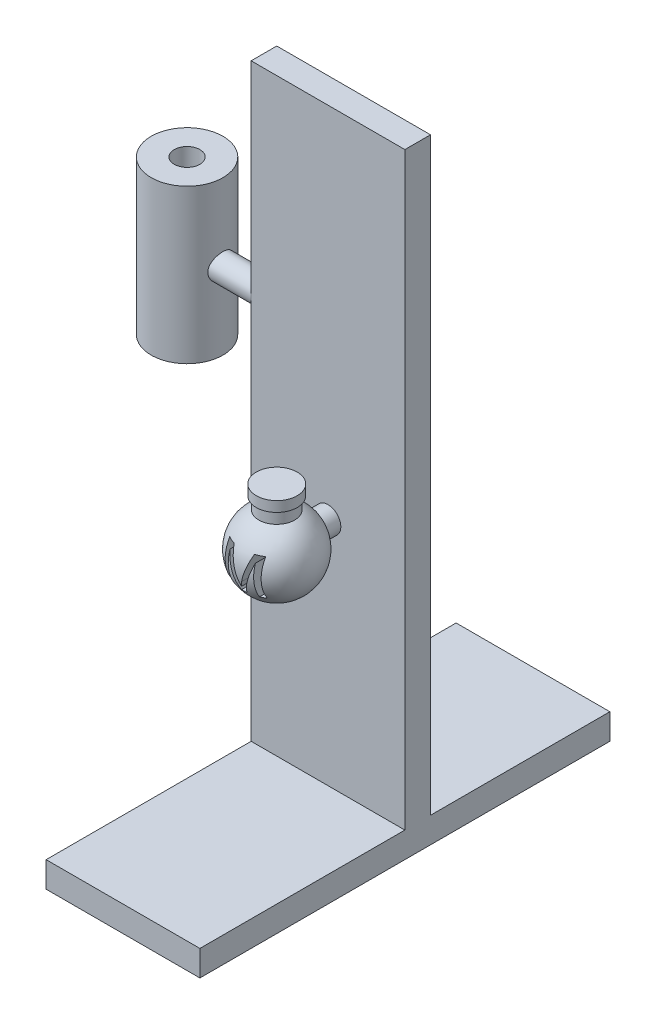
ISO-10303-21;
HEADER;
FILE_DESCRIPTION(('STEP AP214'),'2;1');
FILE_NAME('part.step','',(''),(''),'','','');
FILE_SCHEMA(('AUTOMOTIVE_DESIGN { 1 0 10303 214 1 1 1 1 }'));
ENDSEC;
DATA;
#1=APPLICATION_CONTEXT('core data for automotive mechanical design processes');
#2=APPLICATION_PROTOCOL_DEFINITION('international standard','automotive_design',2000,#1);
#3=PRODUCT_CONTEXT('',#1,'mechanical');
#4=PRODUCT('Part','Part','',(#3));
#5=PRODUCT_RELATED_PRODUCT_CATEGORY('part','',(#4));
#6=PRODUCT_DEFINITION_FORMATION('','',#4);
#7=PRODUCT_DEFINITION_CONTEXT('part definition',#1,'design');
#8=PRODUCT_DEFINITION('design','',#6,#7);
#9=PRODUCT_DEFINITION_SHAPE('','',#8);
#10=(LENGTH_UNIT() NAMED_UNIT(*) SI_UNIT(.MILLI.,.METRE.));
#11=(NAMED_UNIT(*) PLANE_ANGLE_UNIT() SI_UNIT($,.RADIAN.));
#12=(NAMED_UNIT(*) SI_UNIT($,.STERADIAN.) SOLID_ANGLE_UNIT());
#13=UNCERTAINTY_MEASURE_WITH_UNIT(LENGTH_MEASURE(1.E-05),#10,'distance_accuracy_value','');
#14=(GEOMETRIC_REPRESENTATION_CONTEXT(3) GLOBAL_UNCERTAINTY_ASSIGNED_CONTEXT((#13)) GLOBAL_UNIT_ASSIGNED_CONTEXT((#10,
#11,#12)) REPRESENTATION_CONTEXT('',''));
#15=CARTESIAN_POINT('',(0.,0.,0.));
#16=DIRECTION('',(0.,0.,1.));
#17=DIRECTION('',(1.,0.,0.));
#18=AXIS2_PLACEMENT_3D('',#15,#16,#17);
#19=CARTESIAN_POINT('',(0.,120.,5.));
#20=DIRECTION('',(0.,0.,-1.));
#21=DIRECTION('',(-1.,0.,0.));
#22=AXIS2_PLACEMENT_3D('',#19,#20,#21);
#23=PLANE('',#22);
#24=CARTESIAN_POINT('',(15.,50.,5.));
#25=DIRECTION('',(0.,0.,-1.));
#26=DIRECTION('',(-1.,0.,0.));
#27=AXIS2_PLACEMENT_3D('',#24,#25,#26);
#28=CIRCLE('',#27,2.5);
#29=CARTESIAN_POINT('',(12.5,50.,5.));
#30=VERTEX_POINT('',#29);
#31=EDGE_CURVE('E346',#30,#30,#28,.F.);
#32=ORIENTED_EDGE('',*,*,#31,.F.);
#33=EDGE_LOOP('',(#32));
#34=FACE_BOUND('',#33,.T.);
#35=DIRECTION('',(-1.,0.,0.));
#36=VECTOR('',#35,1.);
#37=CARTESIAN_POINT('',(0.,5.,5.));
#38=LINE('',#37,#36);
#39=CARTESIAN_POINT('',(30.,5.,5.));
#40=VERTEX_POINT('',#39);
#41=CARTESIAN_POINT('',(0.,5.,5.));
#42=VERTEX_POINT('',#41);
#43=EDGE_CURVE('E55',#40,#42,#38,.T.);
#44=ORIENTED_EDGE('',*,*,#43,.F.);
#45=DIRECTION('',(0.,1.,0.));
#46=VECTOR('',#45,1.);
#47=CARTESIAN_POINT('',(30.,0.,5.));
#48=LINE('',#47,#46);
#49=CARTESIAN_POINT('',(30.,120.,5.));
#50=VERTEX_POINT('',#49);
#51=EDGE_CURVE('E417',#40,#50,#48,.T.);
#52=ORIENTED_EDGE('',*,*,#51,.T.);
#53=DIRECTION('',(-1.,0.,0.));
#54=VECTOR('',#53,1.);
#55=CARTESIAN_POINT('',(0.,120.,5.));
#56=LINE('',#55,#54);
#57=CARTESIAN_POINT('',(0.,120.,5.));
#58=VERTEX_POINT('',#57);
#59=EDGE_CURVE('E419',#50,#58,#56,.T.);
#60=ORIENTED_EDGE('',*,*,#59,.T.);
#61=DIRECTION('',(0.,-1.,0.));
#62=VECTOR('',#61,1.);
#63=CARTESIAN_POINT('',(0.,0.,5.));
#64=LINE('',#63,#62);
#65=CARTESIAN_POINT('',(0.,80.,5.));
#66=VERTEX_POINT('',#65);
#67=EDGE_CURVE('E415',#58,#66,#64,.T.);
#68=ORIENTED_EDGE('',*,*,#67,.T.);
#69=EDGE_CURVE('E414',#66,#42,#64,.T.);
#70=ORIENTED_EDGE('',*,*,#69,.T.);
#71=EDGE_LOOP('',(#44,#52,#60,#68,#70));
#72=FACE_BOUND('',#71,.T.);
#73=ADVANCED_FACE('F32',(#34,#72),#23,.F.);
#74=CARTESIAN_POINT('',(0.,120.,0.));
#75=DIRECTION('',(0.,0.,-1.));
#76=DIRECTION('',(-1.,0.,0.));
#77=AXIS2_PLACEMENT_3D('',#74,#75,#76);
#78=PLANE('',#77);
#79=DIRECTION('',(0.,1.,0.));
#80=VECTOR('',#79,1.);
#81=CARTESIAN_POINT('',(30.,0.,0.));
#82=LINE('',#81,#80);
#83=CARTESIAN_POINT('',(30.,5.,0.));
#84=VERTEX_POINT('',#83);
#85=CARTESIAN_POINT('',(30.,120.,0.));
#86=VERTEX_POINT('',#85);
#87=EDGE_CURVE('E409',#84,#86,#82,.T.);
#88=ORIENTED_EDGE('',*,*,#87,.F.);
#89=DIRECTION('',(-1.,0.,0.));
#90=VECTOR('',#89,1.);
#91=CARTESIAN_POINT('',(0.,5.,0.));
#92=LINE('',#91,#90);
#93=CARTESIAN_POINT('',(0.,5.,0.));
#94=VERTEX_POINT('',#93);
#95=EDGE_CURVE('E442',#84,#94,#92,.T.);
#96=ORIENTED_EDGE('',*,*,#95,.T.);
#97=DIRECTION('',(0.,-1.,0.));
#98=VECTOR('',#97,1.);
#99=CARTESIAN_POINT('',(0.,0.,0.));
#100=LINE('',#99,#98);
#101=CARTESIAN_POINT('',(0.,80.,0.));
#102=VERTEX_POINT('',#101);
#103=EDGE_CURVE('E410',#102,#94,#100,.T.);
#104=ORIENTED_EDGE('',*,*,#103,.F.);
#105=CARTESIAN_POINT('',(0.,120.,0.));
#106=VERTEX_POINT('',#105);
#107=EDGE_CURVE('E406',#106,#102,#100,.T.);
#108=ORIENTED_EDGE('',*,*,#107,.F.);
#109=DIRECTION('',(-1.,0.,0.));
#110=VECTOR('',#109,1.);
#111=CARTESIAN_POINT('',(0.,120.,0.));
#112=LINE('',#111,#110);
#113=EDGE_CURVE('E412',#86,#106,#112,.T.);
#114=ORIENTED_EDGE('',*,*,#113,.F.);
#115=EDGE_LOOP('',(#88,#96,#104,#108,#114));
#116=FACE_BOUND('',#115,.T.);
#117=ADVANCED_FACE('F314',(#116),#78,.T.);
#118=CARTESIAN_POINT('',(-15.,80.,2.5));
#119=DIRECTION('',(1.,0.,0.));
#120=DIRECTION('',(0.,0.,-1.));
#121=AXIS2_PLACEMENT_3D('',#118,#119,#120);
#122=CYLINDRICAL_SURFACE('',#121,2.5);
#123=CARTESIAN_POINT('',(0.,80.,2.5));
#124=DIRECTION('',(-1.,0.,0.));
#125=DIRECTION('',(0.,0.,1.));
#126=AXIS2_PLACEMENT_3D('',#123,#124,#125);
#127=CIRCLE('',#126,2.5);
#128=EDGE_CURVE('E392',#66,#102,#127,.T.);
#129=ORIENTED_EDGE('',*,*,#128,.T.);
#130=EDGE_CURVE('E396',#102,#66,#127,.T.);
#131=ORIENTED_EDGE('',*,*,#130,.T.);
#132=EDGE_LOOP('',(#129,#131));
#133=FACE_BOUND('',#132,.T.);
#134=CARTESIAN_POINT('',(-8.46165158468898,80.,0.));
#135=CARTESIAN_POINT('',(-8.46165415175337,79.8644729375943,-2.93142536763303E-06));
#136=CARTESIAN_POINT('',(-8.45739186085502,79.7289661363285,0.0110575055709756));
#137=CARTESIAN_POINT('',(-8.44090884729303,79.4620070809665,0.0548290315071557));
#138=CARTESIAN_POINT('',(-8.42868773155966,79.3305550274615,0.0875411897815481));
#139=CARTESIAN_POINT('',(-8.39784418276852,79.0756252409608,0.173288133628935));
#140=CARTESIAN_POINT('',(-8.37923583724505,78.9521306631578,0.226278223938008));
#141=CARTESIAN_POINT('',(-8.33773622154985,78.7157391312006,0.350920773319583));
#142=CARTESIAN_POINT('',(-8.3148438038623,78.6028450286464,0.422578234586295));
#143=CARTESIAN_POINT('',(-8.26620067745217,78.3857788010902,0.585975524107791));
#144=CARTESIAN_POINT('',(-8.24037136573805,78.2821521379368,0.678416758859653));
#145=CARTESIAN_POINT('',(-8.18942419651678,78.0914931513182,0.87926548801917));
#146=CARTESIAN_POINT('',(-8.16430647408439,78.004463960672,0.987675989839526));
#147=CARTESIAN_POINT('',(-8.11668902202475,77.8469109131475,1.22145912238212));
#148=CARTESIAN_POINT('',(-8.09429233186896,77.7769705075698,1.34724781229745));
#149=CARTESIAN_POINT('',(-8.05557693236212,77.659464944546,1.60974493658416));
#150=CARTESIAN_POINT('',(-8.03925632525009,77.6118927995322,1.74644994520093));
#151=CARTESIAN_POINT('',(-8.01508938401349,77.5423590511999,2.0211712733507));
#152=CARTESIAN_POINT('',(-8.00693390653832,77.5194604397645,2.15892271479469));
#153=CARTESIAN_POINT('',(-7.99891202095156,77.4969316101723,2.43653827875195));
#154=CARTESIAN_POINT('',(-7.99904316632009,77.4972945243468,2.57640176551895));
#155=CARTESIAN_POINT('',(-8.00737739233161,77.5207111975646,2.84759237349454));
#156=CARTESIAN_POINT('',(-8.01521745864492,77.5427445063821,2.97902065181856));
#157=CARTESIAN_POINT('',(-8.03762148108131,77.6071728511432,3.23617413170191));
#158=CARTESIAN_POINT('',(-8.05218590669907,77.6495693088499,3.36189893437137));
#159=CARTESIAN_POINT('',(-8.08683492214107,77.7540469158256,3.60616096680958));
#160=CARTESIAN_POINT('',(-8.10699405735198,77.8163957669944,3.72457268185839));
#161=CARTESIAN_POINT('',(-8.1507664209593,77.9587791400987,3.94953519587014));
#162=CARTESIAN_POINT('',(-8.17438070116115,78.0388190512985,4.05608236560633));
#163=CARTESIAN_POINT('',(-8.22409646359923,78.2193307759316,4.26033248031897));
#164=CARTESIAN_POINT('',(-8.25026342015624,78.3206669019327,4.35725678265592));
#165=CARTESIAN_POINT('',(-8.3011003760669,78.5383434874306,4.53301110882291));
#166=CARTESIAN_POINT('',(-8.32577006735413,78.6546870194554,4.61183741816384));
#167=CARTESIAN_POINT('',(-8.37120875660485,78.9018776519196,4.75045901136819));
#168=CARTESIAN_POINT('',(-8.39189723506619,79.0329530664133,4.80987563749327));
#169=CARTESIAN_POINT('',(-8.42610260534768,79.304179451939,4.90551106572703));
#170=CARTESIAN_POINT('',(-8.43962304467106,79.4443258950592,4.94174134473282));
#171=CARTESIAN_POINT('',(-8.45713994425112,79.7220838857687,4.98828716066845));
#172=CARTESIAN_POINT('',(-8.46158583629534,79.859461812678,4.99982704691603));
#173=CARTESIAN_POINT('',(-8.46171581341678,80.1342333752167,5.00016897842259));
#174=CARTESIAN_POINT('',(-8.45740180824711,80.2716270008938,4.98897597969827));
#175=CARTESIAN_POINT('',(-8.44095095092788,80.5365737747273,4.94527599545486));
#176=CARTESIAN_POINT('',(-8.42914582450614,80.6642987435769,4.91367185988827));
#177=CARTESIAN_POINT('',(-8.39942381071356,80.9125899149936,4.83115923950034));
#178=CARTESIAN_POINT('',(-8.38150574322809,81.0331547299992,4.78024702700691));
#179=CARTESIAN_POINT('',(-8.34080102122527,81.2684001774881,4.65854403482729));
#180=CARTESIAN_POINT('',(-8.31786560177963,81.3827259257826,4.58711845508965));
#181=CARTESIAN_POINT('',(-8.2699770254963,81.598207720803,4.42711056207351));
#182=CARTESIAN_POINT('',(-8.24502319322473,81.6993593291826,4.33852249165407));
#183=CARTESIAN_POINT('',(-8.1942043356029,81.8915426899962,4.14077043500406));
#184=CARTESIAN_POINT('',(-8.16836752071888,81.9816793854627,4.03072651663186));
#185=CARTESIAN_POINT('',(-8.12006270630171,82.1422926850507,3.79643714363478));
#186=CARTESIAN_POINT('',(-8.09759465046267,82.2127696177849,3.67219192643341));
#187=CARTESIAN_POINT('',(-8.05862015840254,82.3315002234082,3.41338047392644));
#188=CARTESIAN_POINT('',(-8.04208373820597,82.3798660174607,3.27887043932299));
#189=CARTESIAN_POINT('',(-8.01671664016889,82.4530468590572,3.00290689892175));
#190=CARTESIAN_POINT('',(-8.00788271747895,82.4778718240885,2.86145634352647));
#191=CARTESIAN_POINT('',(-7.9991961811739,82.5022729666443,2.58375750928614));
#192=CARTESIAN_POINT('',(-7.99888934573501,82.5031261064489,2.44763455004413));
#193=CARTESIAN_POINT('',(-8.00613634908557,82.4827846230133,2.17727319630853));
#194=CARTESIAN_POINT('',(-8.01368938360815,82.4615922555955,2.04303461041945));
#195=CARTESIAN_POINT('',(-8.03561688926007,82.3986398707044,1.78301867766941));
#196=CARTESIAN_POINT('',(-8.04984871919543,82.3573092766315,1.65712444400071));
#197=CARTESIAN_POINT('',(-8.08366112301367,82.2556669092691,1.41402856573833));
#198=CARTESIAN_POINT('',(-8.10324269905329,82.1953515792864,1.29682855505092));
#199=CARTESIAN_POINT('',(-8.14674509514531,82.0546886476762,1.06931766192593));
#200=CARTESIAN_POINT('',(-8.17080828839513,81.9736355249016,0.959470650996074));
#201=CARTESIAN_POINT('',(-8.22028953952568,81.7949475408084,0.75453152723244));
#202=CARTESIAN_POINT('',(-8.24570805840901,81.6973070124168,0.659444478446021));
#203=CARTESIAN_POINT('',(-8.29647116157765,81.4827811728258,0.482177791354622));
#204=CARTESIAN_POINT('',(-8.32175686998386,81.3652101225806,0.400808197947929));
#205=CARTESIAN_POINT('',(-8.36799648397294,81.1172615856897,0.258992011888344));
#206=CARTESIAN_POINT('',(-8.38895068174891,80.9868849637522,0.198544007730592));
#207=CARTESIAN_POINT('',(-8.42390786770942,80.7162590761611,0.100466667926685));
#208=CARTESIAN_POINT('',(-8.43788173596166,80.5759711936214,0.0629327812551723));
#209=CARTESIAN_POINT('',(-8.4567499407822,80.2904461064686,0.0127072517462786));
#210=CARTESIAN_POINT('',(-8.46164883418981,80.1452114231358,3.14089630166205E-06));
#211=CARTESIAN_POINT('',(-8.46165158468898,80.,0.));
#212=B_SPLINE_CURVE_WITH_KNOTS('',3,(#134,#135,#136,#137,#138,#139,#140,#141,#142,#143,#144,
#145,#146,#147,#148,#149,#150,#151,#152,#153,#154,#155,#156,#157,#158,#159,#160,#161,#162,#163,
#164,#165,#166,#167,#168,#169,#170,#171,#172,#173,#174,#175,#176,#177,#178,#179,#180,#181,#182,
#183,#184,#185,#186,#187,#188,#189,#190,#191,#192,#193,#194,#195,#196,#197,#198,#199,#200,#201,
#202,#203,#204,#205,#206,#207,#208,#209,#210,#211),.UNSPECIFIED.,.T.,.F.,(4,2,2,2,2,2,2,2,2,2,2,
2,2,2,2,2,2,2,2,2,2,2,2,2,2,2,2,2,2,2,2,2,2,2,2,2,2,2,4),(0.,0.406041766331,0.812103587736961,
1.21727550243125,1.62255610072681,2.04441002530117,2.46634349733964,2.90112813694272,
3.33577686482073,3.75326460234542,4.17062908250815,4.56923737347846,4.96787349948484,
5.37209971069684,5.77644923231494,6.20244167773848,6.62852147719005,7.06247609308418,
7.49621574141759,7.90789453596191,8.31948358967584,8.71400941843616,9.10861145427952,
9.5170588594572,9.92564351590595,10.3573204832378,10.7889902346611,11.2184461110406,
11.6477209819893,12.0540827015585,12.4604028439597,12.8584146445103,13.2565010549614,
13.67053016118,14.0847010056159,14.5182116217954,14.9516929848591,15.386967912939,
15.8220242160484),.UNSPECIFIED.);
#213=CARTESIAN_POINT('',(-8.46165158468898,80.,0.));
#214=VERTEX_POINT('',#213);
#215=EDGE_CURVE('E435',#214,#214,#212,.T.);
#216=ORIENTED_EDGE('',*,*,#215,.F.);
#217=EDGE_LOOP('',(#216));
#218=FACE_BOUND('',#217,.T.);
#219=ADVANCED_FACE('F317',(#133,#218),#122,.T.);
#220=CARTESIAN_POINT('',(0.,0.,5.));
#221=DIRECTION('',(1.,0.,0.));
#222=DIRECTION('',(0.,0.,-1.));
#223=AXIS2_PLACEMENT_3D('',#220,#221,#222);
#224=PLANE('',#223);
#225=ORIENTED_EDGE('',*,*,#128,.F.);
#226=ORIENTED_EDGE('',*,*,#67,.F.);
#227=DIRECTION('',(0.,0.,-1.));
#228=VECTOR('',#227,1.);
#229=CARTESIAN_POINT('',(0.,120.,5.));
#230=LINE('',#229,#228);
#231=EDGE_CURVE('E421',#58,#106,#230,.T.);
#232=ORIENTED_EDGE('',*,*,#231,.T.);
#233=ORIENTED_EDGE('',*,*,#107,.T.);
#234=EDGE_LOOP('',(#225,#226,#232,#233));
#235=FACE_BOUND('',#234,.T.);
#236=ADVANCED_FACE('F34',(#235),#224,.F.);
#237=DIRECTION('',(0.,0.,-1.));
#238=VECTOR('',#237,1.);
#239=CARTESIAN_POINT('',(0.,0.,5.));
#240=LINE('',#239,#238);
#241=CARTESIAN_POINT('',(0.,0.,45.));
#242=VERTEX_POINT('',#241);
#243=CARTESIAN_POINT('',(0.,0.,-35.));
#244=VERTEX_POINT('',#243);
#245=EDGE_CURVE('E338',#242,#244,#240,.T.);
#246=ORIENTED_EDGE('',*,*,#245,.F.);
#247=DIRECTION('',(0.,-1.,0.));
#248=VECTOR('',#247,1.);
#249=CARTESIAN_POINT('',(0.,0.,45.));
#250=LINE('',#249,#248);
#251=CARTESIAN_POINT('',(0.,5.,45.));
#252=VERTEX_POINT('',#251);
#253=EDGE_CURVE('E371',#252,#242,#250,.T.);
#254=ORIENTED_EDGE('',*,*,#253,.F.);
#255=DIRECTION('',(0.,0.,-1.));
#256=VECTOR('',#255,1.);
#257=CARTESIAN_POINT('',(0.,5.,45.));
#258=LINE('',#257,#256);
#259=EDGE_CURVE('E378',#252,#42,#258,.T.);
#260=ORIENTED_EDGE('',*,*,#259,.T.);
#261=ORIENTED_EDGE('',*,*,#69,.F.);
#262=ORIENTED_EDGE('',*,*,#130,.F.);
#263=ORIENTED_EDGE('',*,*,#103,.T.);
#264=CARTESIAN_POINT('',(0.,5.,-35.));
#265=VERTEX_POINT('',#264);
#266=EDGE_CURVE('E360',#94,#265,#258,.T.);
#267=ORIENTED_EDGE('',*,*,#266,.T.);
#268=DIRECTION('',(0.,-1.,0.));
#269=VECTOR('',#268,1.);
#270=CARTESIAN_POINT('',(0.,0.,-35.));
#271=LINE('',#270,#269);
#272=EDGE_CURVE('E354',#265,#244,#271,.T.);
#273=ORIENTED_EDGE('',*,*,#272,.T.);
#274=EDGE_LOOP('',(#246,#254,#260,#261,#262,#263,#267,#273));
#275=FACE_BOUND('',#274,.T.);
#276=ADVANCED_FACE('F330',(#275),#224,.F.);
#277=CARTESIAN_POINT('',(0.,0.,5.));
#278=DIRECTION('',(0.,1.,0.));
#279=DIRECTION('',(0.,0.,1.));
#280=AXIS2_PLACEMENT_3D('',#277,#278,#279);
#281=PLANE('',#280);
#282=ORIENTED_EDGE('',*,*,#245,.T.);
#283=DIRECTION('',(1.,0.,0.));
#284=VECTOR('',#283,1.);
#285=CARTESIAN_POINT('',(0.,0.,-35.));
#286=LINE('',#285,#284);
#287=CARTESIAN_POINT('',(30.,0.,-35.));
#288=VERTEX_POINT('',#287);
#289=EDGE_CURVE('E340',#244,#288,#286,.T.);
#290=ORIENTED_EDGE('',*,*,#289,.T.);
#291=DIRECTION('',(0.,0.,-1.));
#292=VECTOR('',#291,1.);
#293=CARTESIAN_POINT('',(30.,0.,5.));
#294=LINE('',#293,#292);
#295=CARTESIAN_POINT('',(30.,0.,45.));
#296=VERTEX_POINT('',#295);
#297=EDGE_CURVE('E347',#296,#288,#294,.T.);
#298=ORIENTED_EDGE('',*,*,#297,.F.);
#299=DIRECTION('',(1.,0.,0.));
#300=VECTOR('',#299,1.);
#301=CARTESIAN_POINT('',(0.,0.,45.));
#302=LINE('',#301,#300);
#303=EDGE_CURVE('E342',#242,#296,#302,.T.);
#304=ORIENTED_EDGE('',*,*,#303,.F.);
#305=EDGE_LOOP('',(#282,#290,#298,#304));
#306=FACE_BOUND('',#305,.T.);
#307=ADVANCED_FACE('F327',(#306),#281,.F.);
#308=CARTESIAN_POINT('',(30.,0.,5.));
#309=DIRECTION('',(-1.,0.,0.));
#310=DIRECTION('',(0.,0.,1.));
#311=AXIS2_PLACEMENT_3D('',#308,#309,#310);
#312=PLANE('',#311);
#313=ORIENTED_EDGE('',*,*,#297,.T.);
#314=DIRECTION('',(0.,1.,0.));
#315=VECTOR('',#314,1.);
#316=CARTESIAN_POINT('',(30.,0.,-35.));
#317=LINE('',#316,#315);
#318=CARTESIAN_POINT('',(30.,5.,-35.));
#319=VERTEX_POINT('',#318);
#320=EDGE_CURVE('E357',#288,#319,#317,.T.);
#321=ORIENTED_EDGE('',*,*,#320,.T.);
#322=DIRECTION('',(0.,0.,-1.));
#323=VECTOR('',#322,1.);
#324=CARTESIAN_POINT('',(30.,5.,45.));
#325=LINE('',#324,#323);
#326=EDGE_CURVE('E381',#84,#319,#325,.T.);
#327=ORIENTED_EDGE('',*,*,#326,.F.);
#328=ORIENTED_EDGE('',*,*,#87,.T.);
#329=DIRECTION('',(0.,0.,-1.));
#330=VECTOR('',#329,1.);
#331=CARTESIAN_POINT('',(30.,120.,5.));
#332=LINE('',#331,#330);
#333=EDGE_CURVE('E424',#50,#86,#332,.T.);
#334=ORIENTED_EDGE('',*,*,#333,.F.);
#335=ORIENTED_EDGE('',*,*,#51,.F.);
#336=CARTESIAN_POINT('',(30.,5.,45.));
#337=VERTEX_POINT('',#336);
#338=EDGE_CURVE('E382',#337,#40,#325,.T.);
#339=ORIENTED_EDGE('',*,*,#338,.F.);
#340=DIRECTION('',(0.,1.,0.));
#341=VECTOR('',#340,1.);
#342=CARTESIAN_POINT('',(30.,0.,45.));
#343=LINE('',#342,#341);
#344=EDGE_CURVE('E374',#296,#337,#343,.T.);
#345=ORIENTED_EDGE('',*,*,#344,.F.);
#346=EDGE_LOOP('',(#313,#321,#327,#328,#334,#335,#339,#345));
#347=FACE_BOUND('',#346,.T.);
#348=ADVANCED_FACE('F324',(#347),#312,.F.);
#349=CARTESIAN_POINT('',(0.,120.,5.));
#350=DIRECTION('',(0.,-1.,0.));
#351=DIRECTION('',(0.,0.,-1.));
#352=AXIS2_PLACEMENT_3D('',#349,#350,#351);
#353=PLANE('',#352);
#354=ORIENTED_EDGE('',*,*,#113,.T.);
#355=ORIENTED_EDGE('',*,*,#231,.F.);
#356=ORIENTED_EDGE('',*,*,#59,.F.);
#357=ORIENTED_EDGE('',*,*,#333,.T.);
#358=EDGE_LOOP('',(#354,#355,#356,#357));
#359=FACE_BOUND('',#358,.T.);
#360=ADVANCED_FACE('F312',(#359),#353,.F.);
#361=CARTESIAN_POINT('',(15.,50.,15.));
#362=DIRECTION('',(0.,0.,-1.));
#363=DIRECTION('',(-1.,0.,0.));
#364=AXIS2_PLACEMENT_3D('',#361,#362,#363);
#365=CYLINDRICAL_SURFACE('',#364,2.5);
#366=CARTESIAN_POINT('',(15.,50.,7.92893218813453));
#367=DIRECTION('',(0.,0.,1.));
#368=DIRECTION('',(1.,0.,0.));
#369=AXIS2_PLACEMENT_3D('',#366,#367,#368);
#370=CIRCLE('',#369,2.5);
#371=CARTESIAN_POINT('',(17.5,50.,7.92893218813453));
#372=VERTEX_POINT('',#371);
#373=EDGE_CURVE('E405',#372,#372,#370,.F.);
#374=ORIENTED_EDGE('',*,*,#373,.T.);
#375=EDGE_LOOP('',(#374));
#376=FACE_BOUND('',#375,.T.);
#377=ORIENTED_EDGE('',*,*,#31,.T.);
#378=EDGE_LOOP('',(#377));
#379=FACE_BOUND('',#378,.T.);
#380=ADVANCED_FACE('F306',(#376,#379),#365,.T.);
#381=CARTESIAN_POINT('',(15.,50.,15.));
#382=DIRECTION('',(0.,1.,0.));
#383=DIRECTION('',(1.,0.,0.));
#384=AXIS2_PLACEMENT_3D('',#381,#382,#383);
#385=SPHERICAL_SURFACE('',#384,7.5);
#386=CARTESIAN_POINT('',(15.,46.1322622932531,15.));
#387=DIRECTION('',(0.,-1.,0.));
#388=DIRECTION('',(0.,0.,-1.));
#389=AXIS2_PLACEMENT_3D('',#386,#387,#388);
#390=CIRCLE('',#389,6.42577660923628);
#391=CARTESIAN_POINT('',(11.6406029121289,46.1322622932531,20.4776871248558));
#392=VERTEX_POINT('',#391);
#393=CARTESIAN_POINT('',(12.6547595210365,46.1322622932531,20.9825121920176));
#394=VERTEX_POINT('',#393);
#395=EDGE_CURVE('E11',#392,#394,#390,.F.);
#396=ORIENTED_EDGE('',*,*,#395,.F.);
#397=CARTESIAN_POINT('',(11.6406029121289,50.,15.));
#398=DIRECTION('',(-1.,0.,0.));
#399=DIRECTION('',(0.,0.,1.));
#400=AXIS2_PLACEMENT_3D('',#397,#398,#399);
#401=CIRCLE('',#400,6.70555375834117);
#402=CARTESIAN_POINT('',(11.6406029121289,53.3235546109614,20.8239536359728));
#403=VERTEX_POINT('',#402);
#404=EDGE_CURVE('E195',#403,#392,#401,.F.);
#405=ORIENTED_EDGE('',*,*,#404,.F.);
#406=CARTESIAN_POINT('',(15.,53.3235546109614,15.));
#407=DIRECTION('',(0.,1.,0.));
#408=DIRECTION('',(0.,0.,1.));
#409=AXIS2_PLACEMENT_3D('',#406,#407,#408);
#410=CIRCLE('',#409,6.72339086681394);
#411=CARTESIAN_POINT('',(13.1661595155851,53.3235546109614,21.4684630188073));
#412=VERTEX_POINT('',#411);
#413=EDGE_CURVE('E497',#412,#403,#410,.F.);
#414=ORIENTED_EDGE('',*,*,#413,.F.);
#415=CARTESIAN_POINT('',(14.2964032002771,49.7758452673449,15.));
#416=DIRECTION('',(0.95281497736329,0.303551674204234,0.));
#417=DIRECTION('',(-0.303551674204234,0.95281497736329,0.));
#418=AXIS2_PLACEMENT_3D('',#415,#416,#417);
#419=CIRCLE('',#418,7.46355854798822);
#420=CARTESIAN_POINT('',(14.773828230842,48.2772611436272,22.2959589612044));
#421=VERTEX_POINT('',#420);
#422=EDGE_CURVE('E294',#421,#412,#419,.F.);
#423=ORIENTED_EDGE('',*,*,#422,.F.);
#424=CARTESIAN_POINT('',(15.0979549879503,47.2213281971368,21.965585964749));
#425=CARTESIAN_POINT('',(15.0948564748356,47.2320672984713,21.9699135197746));
#426=CARTESIAN_POINT('',(15.0917557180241,47.2428166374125,21.9742142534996));
#427=CARTESIAN_POINT('',(15.0855212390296,47.2643281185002,21.9827594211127));
#428=CARTESIAN_POINT('',(15.0823875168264,47.2750902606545,21.9870038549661));
#429=CARTESIAN_POINT('',(15.0760587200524,47.2966193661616,21.9954336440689));
#430=CARTESIAN_POINT('',(15.0728636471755,47.3073863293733,21.9996190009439));
#431=CARTESIAN_POINT('',(15.0663899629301,47.328918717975,22.0079284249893));
#432=CARTESIAN_POINT('',(15.0631113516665,47.3396841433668,22.0120524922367));
#433=CARTESIAN_POINT('',(15.0532149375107,47.3719947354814,22.0243384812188));
#434=CARTESIAN_POINT('',(15.0465365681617,47.3935541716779,22.0324141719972));
#435=CARTESIAN_POINT('',(15.033379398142,47.4368065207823,22.0483685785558));
#436=CARTESIAN_POINT('',(15.026900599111,47.4584994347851,22.0562472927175));
#437=CARTESIAN_POINT('',(15.0139228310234,47.5019520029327,22.0717845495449));
#438=CARTESIAN_POINT('',(15.0074238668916,47.5237116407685,22.0794431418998));
#439=CARTESIAN_POINT('',(14.9942141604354,47.5672486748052,22.0945233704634));
#440=CARTESIAN_POINT('',(14.9875034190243,47.5890260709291,22.1019450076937));
#441=CARTESIAN_POINT('',(14.9740568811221,47.6326462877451,22.1165678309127));
#442=CARTESIAN_POINT('',(14.9673210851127,47.6544891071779,22.1237690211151));
#443=CARTESIAN_POINT('',(14.953916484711,47.6982640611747,22.1379592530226));
#444=CARTESIAN_POINT('',(14.9472476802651,47.7201961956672,22.1449482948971));
#445=CARTESIAN_POINT('',(14.9338333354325,47.7642432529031,22.1587425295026));
#446=CARTESIAN_POINT('',(14.9270875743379,47.7863585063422,22.165546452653));
#447=CARTESIAN_POINT('',(14.9134921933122,47.8306268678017,22.1789217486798));
#448=CARTESIAN_POINT('',(14.9066425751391,47.8527799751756,22.1854931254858));
#449=CARTESIAN_POINT('',(14.8859501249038,47.919295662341,22.20485845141));
#450=CARTESIAN_POINT('',(14.8719633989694,47.9637155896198,22.2173039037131));
#451=CARTESIAN_POINT('',(14.8508627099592,48.0305279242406,22.2352968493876));
#452=CARTESIAN_POINT('',(14.8438035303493,48.0528464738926,22.241186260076));
#453=CARTESIAN_POINT('',(14.8297216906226,48.097552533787,22.2527430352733));
#454=CARTESIAN_POINT('',(14.8226990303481,48.119940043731,22.2584104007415));
#455=CARTESIAN_POINT('',(14.8086972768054,48.1647839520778,22.2695232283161));
#456=CARTESIAN_POINT('',(14.8017181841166,48.1872403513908,22.2749686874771));
#457=CARTESIAN_POINT('',(14.7877720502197,48.2322105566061,22.2856339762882));
#458=CARTESIAN_POINT('',(14.7808050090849,48.2547243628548,22.2908538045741));
#459=CARTESIAN_POINT('',(14.773828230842,48.2772611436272,22.2959589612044));
#460=B_SPLINE_CURVE_WITH_KNOTS('',3,(#424,#425,#426,#427,#428,#429,#430,#431,#432,#433,#434,
#435,#436,#437,#438,#439,#440,#441,#442,#443,#444,#445,#446,#447,#448,#449,#450,#451,#452,#453,
#454,#455,#456,#457,#458,#459),.UNSPECIFIED.,.F.,.F.,(4,2,2,2,2,2,2,2,2,2,2,2,2,2,2,2,2,4),(0.,
0.0359571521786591,0.0719143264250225,0.10787050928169,0.143826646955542,0.215739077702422,
0.287652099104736,0.35954875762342,0.431445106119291,0.503340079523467,0.575234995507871,
0.647538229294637,0.719840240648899,0.864441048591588,0.936853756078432,1.00926615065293,
1.08167950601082,1.15409329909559),.UNSPECIFIED.);
#461=CARTESIAN_POINT('',(15.0979549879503,47.2213281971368,21.965585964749));
#462=VERTEX_POINT('',#461);
#463=EDGE_CURVE('E286',#462,#421,#460,.T.);
#464=ORIENTED_EDGE('',*,*,#463,.F.);
#465=CARTESIAN_POINT('',(15.450893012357,48.3636949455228,22.305422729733));
#466=CARTESIAN_POINT('',(15.4433276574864,48.3395188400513,22.3004745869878));
#467=CARTESIAN_POINT('',(15.4357767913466,48.3153652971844,22.2953938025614));
#468=CARTESIAN_POINT('',(15.4206447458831,48.2671231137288,22.2849750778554));
#469=CARTESIAN_POINT('',(15.4130635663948,48.2430344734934,22.2796371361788));
#470=CARTESIAN_POINT('',(15.3978111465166,48.194940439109,22.2687118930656));
#471=CARTESIAN_POINT('',(15.3901398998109,48.1709350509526,22.2631245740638));
#472=CARTESIAN_POINT('',(15.3747541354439,48.1229992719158,22.2516959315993));
#473=CARTESIAN_POINT('',(15.3670396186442,48.0990688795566,22.245854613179));
#474=CARTESIAN_POINT('',(15.3536248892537,48.0571477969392,22.2353750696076));
#475=CARTESIAN_POINT('',(15.3478980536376,48.0391508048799,22.2307962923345));
#476=CARTESIAN_POINT('',(15.3365848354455,48.0031551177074,22.2214748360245));
#477=CARTESIAN_POINT('',(15.3309984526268,47.9851564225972,22.2167321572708));
#478=CARTESIAN_POINT('',(15.314390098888,47.9311765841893,22.2022662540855));
#479=CARTESIAN_POINT('',(15.3035192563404,47.8952127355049,22.1923054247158));
#480=CARTESIAN_POINT('',(15.2816443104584,47.8234870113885,22.1718183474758));
#481=CARTESIAN_POINT('',(15.2706402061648,47.7877251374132,22.1612920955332));
#482=CARTESIAN_POINT('',(15.2539449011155,47.7342665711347,22.1450921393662));
#483=CARTESIAN_POINT('',(15.2483483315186,47.7164779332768,22.1396237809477));
#484=CARTESIAN_POINT('',(15.2370877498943,47.680964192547,22.1285510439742));
#485=CARTESIAN_POINT('',(15.2314237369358,47.6632390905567,22.1229466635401));
#486=CARTESIAN_POINT('',(15.2201168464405,47.6277469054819,22.111564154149));
#487=CARTESIAN_POINT('',(15.21447416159,47.6099799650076,22.1057853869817));
#488=CARTESIAN_POINT('',(15.2033725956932,47.5744440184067,22.0940607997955));
#489=CARTESIAN_POINT('',(15.1979137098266,47.5566750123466,22.0881149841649));
#490=CARTESIAN_POINT('',(15.1871820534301,47.5211372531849,22.0760570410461));
#491=CARTESIAN_POINT('',(15.1819092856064,47.5033685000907,22.0699449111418));
#492=CARTESIAN_POINT('',(15.1713934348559,47.4678732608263,22.0575731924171));
#493=CARTESIAN_POINT('',(15.1661503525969,47.4501467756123,22.0513136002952));
#494=CARTESIAN_POINT('',(15.1555947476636,47.4147636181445,22.0386592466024));
#495=CARTESIAN_POINT('',(15.1502822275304,47.3971069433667,22.032264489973));
#496=CARTESIAN_POINT('',(15.1396701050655,47.3618428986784,22.0193304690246));
#497=CARTESIAN_POINT('',(15.134370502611,47.3442355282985,22.012791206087));
#498=CARTESIAN_POINT('',(15.1238573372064,47.3090532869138,21.9995604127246));
#499=CARTESIAN_POINT('',(15.1186437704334,47.291478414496,21.992868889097));
#500=CARTESIAN_POINT('',(15.1082686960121,47.2563698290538,21.9793375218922));
#501=CARTESIAN_POINT('',(15.1031071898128,47.2388361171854,21.9724976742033));
#502=CARTESIAN_POINT('',(15.0979549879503,47.2213281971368,21.965585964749));
#503=B_SPLINE_CURVE_WITH_KNOTS('',3,(#465,#466,#467,#468,#469,#470,#471,#472,#473,#474,#475,
#476,#477,#478,#479,#480,#481,#482,#483,#484,#485,#486,#487,#488,#489,#490,#491,#492,#493,#494,
#495,#496,#497,#498,#499,#500,#501,#502),.UNSPECIFIED.,.F.,.F.,(4,2,2,2,2,2,2,2,2,2,2,2,2,2,2,2,
2,2,4),(0.,0.0774324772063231,0.154865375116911,0.232303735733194,0.309740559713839,
0.368039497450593,0.426338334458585,0.54293939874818,0.659541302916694,0.717841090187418,
0.776141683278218,0.834690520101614,0.89323782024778,0.951785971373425,1.01033543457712,
1.06888276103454,1.12742952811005,1.1859736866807,1.24451947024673),.UNSPECIFIED.);
#504=CARTESIAN_POINT('',(15.450893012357,48.3636949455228,22.305422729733));
#505=VERTEX_POINT('',#504);
#506=EDGE_CURVE('E293',#505,#462,#503,.T.);
#507=ORIENTED_EDGE('',*,*,#506,.F.);
#508=CARTESIAN_POINT('',(15.8849026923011,49.7159984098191,15.));
#509=DIRECTION('',(-0.952163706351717,0.305588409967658,0.));
#510=DIRECTION('',(-0.305588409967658,-0.952163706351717,0.));
#511=AXIS2_PLACEMENT_3D('',#508,#509,#510);
#512=CIRCLE('',#511,7.44219660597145);
#513=CARTESIAN_POINT('',(17.0427155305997,53.3235546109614,21.4055677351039));
#514=VERTEX_POINT('',#513);
#515=EDGE_CURVE('E548',#514,#505,#512,.F.);
#516=ORIENTED_EDGE('',*,*,#515,.F.);
#517=CARTESIAN_POINT('',(15.,53.3235546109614,15.));
#518=DIRECTION('',(0.,1.,0.));
#519=DIRECTION('',(0.,0.,1.));
#520=AXIS2_PLACEMENT_3D('',#517,#518,#519);
#521=CIRCLE('',#520,6.72339086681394);
#522=CARTESIAN_POINT('',(18.5553070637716,53.3235546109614,20.7064679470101));
#523=VERTEX_POINT('',#522);
#524=EDGE_CURVE('E549',#523,#514,#521,.F.);
#525=ORIENTED_EDGE('',*,*,#524,.F.);
#526=CARTESIAN_POINT('',(18.5553070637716,50.,15.));
#527=DIRECTION('',(1.,0.,0.));
#528=DIRECTION('',(0.,0.,-1.));
#529=AXIS2_PLACEMENT_3D('',#526,#527,#528);
#530=CIRCLE('',#529,6.60377101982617);
#531=CARTESIAN_POINT('',(18.5553070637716,46.1322622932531,20.3526065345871));
#532=VERTEX_POINT('',#531);
#533=EDGE_CURVE('E552',#532,#523,#530,.F.);
#534=ORIENTED_EDGE('',*,*,#533,.F.);
#535=CARTESIAN_POINT('',(15.,46.1322622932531,15.));
#536=DIRECTION('',(0.,-1.,0.));
#537=DIRECTION('',(0.,0.,-1.));
#538=AXIS2_PLACEMENT_3D('',#535,#536,#537);
#539=CIRCLE('',#538,6.42577660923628);
#540=CARTESIAN_POINT('',(17.541150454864,46.1322622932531,20.9019623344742));
#541=VERTEX_POINT('',#540);
#542=EDGE_CURVE('E556',#541,#532,#539,.F.);
#543=ORIENTED_EDGE('',*,*,#542,.F.);
#544=CARTESIAN_POINT('',(17.541150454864,50.,15.));
#545=DIRECTION('',(-1.,0.,0.));
#546=DIRECTION('',(0.,0.,1.));
#547=AXIS2_PLACEMENT_3D('',#544,#545,#546);
#548=CIRCLE('',#547,7.05638394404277);
#549=CARTESIAN_POINT('',(17.541150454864,52.2172019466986,21.6989976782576));
#550=VERTEX_POINT('',#549);
#551=EDGE_CURVE('E558',#550,#541,#548,.F.);
#552=ORIENTED_EDGE('',*,*,#551,.F.);
#553=CARTESIAN_POINT('',(16.6753767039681,49.471685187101,15.));
#554=DIRECTION('',(0.953705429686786,-0.300742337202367,0.));
#555=DIRECTION('',(0.300742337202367,0.953705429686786,0.));
#556=AXIS2_PLACEMENT_3D('',#553,#554,#555);
#557=CIRCLE('',#556,7.29136450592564);
#558=CARTESIAN_POINT('',(15.6223200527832,46.1322622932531,21.3955705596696));
#559=VERTEX_POINT('',#558);
#560=EDGE_CURVE('E560',#559,#550,#557,.F.);
#561=ORIENTED_EDGE('',*,*,#560,.F.);
#562=CARTESIAN_POINT('',(15.,46.1322622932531,15.));
#563=DIRECTION('',(0.,-1.,0.));
#564=DIRECTION('',(0.,0.,-1.));
#565=AXIS2_PLACEMENT_3D('',#562,#563,#564);
#566=CIRCLE('',#565,6.42577660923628);
#567=CARTESIAN_POINT('',(14.562065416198,46.1322622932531,21.4108360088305));
#568=VERTEX_POINT('',#567);
#569=EDGE_CURVE('E562',#568,#559,#566,.F.);
#570=ORIENTED_EDGE('',*,*,#569,.F.);
#571=CARTESIAN_POINT('',(13.4973669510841,49.5290042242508,15.));
#572=DIRECTION('',(-0.954222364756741,-0.299098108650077,0.));
#573=DIRECTION('',(0.299098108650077,-0.954222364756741,0.));
#574=AXIS2_PLACEMENT_3D('',#571,#572,#573);
#575=CIRCLE('',#574,7.33282052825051);
#576=CARTESIAN_POINT('',(12.6547595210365,52.2172019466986,21.7700710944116));
#577=VERTEX_POINT('',#576);
#578=EDGE_CURVE('E564',#577,#568,#575,.F.);
#579=ORIENTED_EDGE('',*,*,#578,.F.);
#580=CARTESIAN_POINT('',(12.6547595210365,50.,15.));
#581=DIRECTION('',(1.,0.,0.));
#582=DIRECTION('',(0.,0.,-1.));
#583=AXIS2_PLACEMENT_3D('',#580,#581,#582);
#584=CIRCLE('',#583,7.12389269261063);
#585=EDGE_CURVE('E40',#394,#577,#584,.F.);
#586=ORIENTED_EDGE('',*,*,#585,.F.);
#587=EDGE_LOOP('',(#396,#405,#414,#423,#464,#507,#516,#525,#534,#543,#552,#561,#570,#579,#586));
#588=FACE_BOUND('',#587,.T.);
#589=CARTESIAN_POINT('',(15.,56.6332495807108,15.));
#590=DIRECTION('',(0.,-1.,0.));
#591=DIRECTION('',(0.,0.,-1.));
#592=AXIS2_PLACEMENT_3D('',#589,#590,#591);
#593=CIRCLE('',#592,3.5);
#594=CARTESIAN_POINT('',(15.,56.6332495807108,11.5));
#595=VERTEX_POINT('',#594);
#596=EDGE_CURVE('E430',#595,#595,#593,.F.);
#597=ORIENTED_EDGE('',*,*,#596,.F.);
#598=EDGE_LOOP('',(#597));
#599=FACE_BOUND('',#598,.T.);
#600=ORIENTED_EDGE('',*,*,#373,.F.);
#601=EDGE_LOOP('',(#600));
#602=FACE_BOUND('',#601,.T.);
#603=ADVANCED_FACE('F300',(#588,#599,#602),#385,.T.);
#604=CARTESIAN_POINT('',(15.,59.,15.));
#605=DIRECTION('',(0.,-1.,0.));
#606=DIRECTION('',(0.,0.,-1.));
#607=AXIS2_PLACEMENT_3D('',#604,#605,#606);
#608=CYLINDRICAL_SURFACE('',#607,3.5);
#609=ORIENTED_EDGE('',*,*,#596,.T.);
#610=EDGE_LOOP('',(#609));
#611=FACE_BOUND('',#610,.T.);
#612=CARTESIAN_POINT('',(15.,59.,15.));
#613=DIRECTION('',(0.,1.,0.));
#614=DIRECTION('',(0.,0.,1.));
#615=AXIS2_PLACEMENT_3D('',#612,#613,#614);
#616=CIRCLE('',#615,3.5);
#617=CARTESIAN_POINT('',(15.,59.,18.5));
#618=VERTEX_POINT('',#617);
#619=EDGE_CURVE('E402',#618,#618,#616,.F.);
#620=ORIENTED_EDGE('',*,*,#619,.T.);
#621=EDGE_LOOP('',(#620));
#622=FACE_BOUND('',#621,.T.);
#623=ADVANCED_FACE('F305',(#611,#622),#608,.T.);
#624=CARTESIAN_POINT('',(15.,61.,15.));
#625=DIRECTION('',(0.,-1.,0.));
#626=DIRECTION('',(0.,0.,-1.));
#627=AXIS2_PLACEMENT_3D('',#624,#625,#626);
#628=CYLINDRICAL_SURFACE('',#627,4.);
#629=CARTESIAN_POINT('',(15.,61.,15.));
#630=DIRECTION('',(0.,1.,0.));
#631=DIRECTION('',(0.,0.,1.));
#632=AXIS2_PLACEMENT_3D('',#629,#630,#631);
#633=CIRCLE('',#632,4.);
#634=CARTESIAN_POINT('',(15.,61.,19.));
#635=VERTEX_POINT('',#634);
#636=EDGE_CURVE('E399',#635,#635,#633,.T.);
#637=ORIENTED_EDGE('',*,*,#636,.F.);
#638=EDGE_LOOP('',(#637));
#639=FACE_BOUND('',#638,.T.);
#640=CARTESIAN_POINT('',(15.,59.,15.));
#641=DIRECTION('',(0.,1.,0.));
#642=DIRECTION('',(0.,0.,1.));
#643=AXIS2_PLACEMENT_3D('',#640,#641,#642);
#644=CIRCLE('',#643,4.);
#645=CARTESIAN_POINT('',(15.,59.,19.));
#646=VERTEX_POINT('',#645);
#647=EDGE_CURVE('E395',#646,#646,#644,.T.);
#648=ORIENTED_EDGE('',*,*,#647,.T.);
#649=EDGE_LOOP('',(#648));
#650=FACE_BOUND('',#649,.T.);
#651=ADVANCED_FACE('F833',(#639,#650),#628,.T.);
#652=CARTESIAN_POINT('',(15.,61.,15.));
#653=DIRECTION('',(0.,1.,0.));
#654=DIRECTION('',(0.,0.,1.));
#655=AXIS2_PLACEMENT_3D('',#652,#653,#654);
#656=PLANE('',#655);
#657=ORIENTED_EDGE('',*,*,#636,.T.);
#658=EDGE_LOOP('',(#657));
#659=FACE_BOUND('',#658,.T.);
#660=ADVANCED_FACE('F824',(#659),#656,.T.);
#661=CARTESIAN_POINT('',(15.,59.,15.));
#662=DIRECTION('',(0.,1.,0.));
#663=DIRECTION('',(0.,0.,1.));
#664=AXIS2_PLACEMENT_3D('',#661,#662,#663);
#665=PLANE('',#664);
#666=ORIENTED_EDGE('',*,*,#619,.F.);
#667=EDGE_LOOP('',(#666));
#668=FACE_BOUND('',#667,.T.);
#669=ORIENTED_EDGE('',*,*,#647,.F.);
#670=EDGE_LOOP('',(#669));
#671=FACE_BOUND('',#670,.T.);
#672=ADVANCED_FACE('F452',(#668,#671),#665,.F.);
#673=CARTESIAN_POINT('',(-15.,101.070950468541,2.5));
#674=DIRECTION('',(0.,1.,0.));
#675=DIRECTION('',(-1.,0.,0.));
#676=AXIS2_PLACEMENT_3D('',#673,#674,#675);
#677=CYLINDRICAL_SURFACE('',#676,7.);
#678=CARTESIAN_POINT('',(-15.,65.,2.5));
#679=DIRECTION('',(0.,1.,0.));
#680=DIRECTION('',(-1.,0.,0.));
#681=AXIS2_PLACEMENT_3D('',#678,#679,#680);
#682=CIRCLE('',#681,7.);
#683=CARTESIAN_POINT('',(-22.,65.,2.5));
#684=VERTEX_POINT('',#683);
#685=EDGE_CURVE('E389',#684,#684,#682,.T.);
#686=ORIENTED_EDGE('',*,*,#685,.T.);
#687=EDGE_LOOP('',(#686));
#688=FACE_BOUND('',#687,.T.);
#689=CARTESIAN_POINT('',(-15.,95.,2.5));
#690=DIRECTION('',(0.,1.,0.));
#691=DIRECTION('',(-1.,0.,0.));
#692=AXIS2_PLACEMENT_3D('',#689,#690,#691);
#693=CIRCLE('',#692,7.);
#694=CARTESIAN_POINT('',(-22.,95.,2.5));
#695=VERTEX_POINT('',#694);
#696=EDGE_CURVE('E386',#695,#695,#693,.T.);
#697=ORIENTED_EDGE('',*,*,#696,.F.);
#698=EDGE_LOOP('',(#697));
#699=FACE_BOUND('',#698,.T.);
#700=ORIENTED_EDGE('',*,*,#215,.T.);
#701=EDGE_LOOP('',(#700));
#702=FACE_BOUND('',#701,.T.);
#703=ADVANCED_FACE('F447',(#688,#699,#702),#677,.T.);
#704=CARTESIAN_POINT('',(-15.,65.,2.5));
#705=DIRECTION('',(0.,1.,0.));
#706=DIRECTION('',(-1.,0.,0.));
#707=AXIS2_PLACEMENT_3D('',#704,#705,#706);
#708=PLANE('',#707);
#709=CARTESIAN_POINT('',(-15.,65.,2.5));
#710=DIRECTION('',(0.,1.,0.));
#711=DIRECTION('',(-1.,0.,0.));
#712=AXIS2_PLACEMENT_3D('',#709,#710,#711);
#713=CIRCLE('',#712,2.5);
#714=CARTESIAN_POINT('',(-17.5,65.,2.5));
#715=VERTEX_POINT('',#714);
#716=EDGE_CURVE('E361',#715,#715,#713,.T.);
#717=ORIENTED_EDGE('',*,*,#716,.T.);
#718=EDGE_LOOP('',(#717));
#719=FACE_BOUND('',#718,.T.);
#720=ORIENTED_EDGE('',*,*,#685,.F.);
#721=EDGE_LOOP('',(#720));
#722=FACE_BOUND('',#721,.T.);
#723=ADVANCED_FACE('F451',(#719,#722),#708,.F.);
#724=CARTESIAN_POINT('',(-15.,95.,2.5));
#725=DIRECTION('',(0.,-1.,0.));
#726=DIRECTION('',(1.,0.,0.));
#727=AXIS2_PLACEMENT_3D('',#724,#725,#726);
#728=PLANE('',#727);
#729=CARTESIAN_POINT('',(-15.,95.,2.5));
#730=DIRECTION('',(0.,1.,0.));
#731=DIRECTION('',(-1.,0.,0.));
#732=AXIS2_PLACEMENT_3D('',#729,#730,#731);
#733=CIRCLE('',#732,2.5);
#734=CARTESIAN_POINT('',(-17.5,95.,2.5));
#735=VERTEX_POINT('',#734);
#736=EDGE_CURVE('E364',#735,#735,#733,.T.);
#737=ORIENTED_EDGE('',*,*,#736,.F.);
#738=EDGE_LOOP('',(#737));
#739=FACE_BOUND('',#738,.T.);
#740=ORIENTED_EDGE('',*,*,#696,.T.);
#741=EDGE_LOOP('',(#740));
#742=FACE_BOUND('',#741,.T.);
#743=ADVANCED_FACE('F454',(#739,#742),#728,.F.);
#744=CARTESIAN_POINT('',(0.,5.,-35.));
#745=DIRECTION('',(0.,0.,-1.));
#746=DIRECTION('',(-1.,0.,0.));
#747=AXIS2_PLACEMENT_3D('',#744,#745,#746);
#748=PLANE('',#747);
#749=ORIENTED_EDGE('',*,*,#272,.F.);
#750=DIRECTION('',(-1.,0.,0.));
#751=VECTOR('',#750,1.);
#752=CARTESIAN_POINT('',(0.,5.,-35.));
#753=LINE('',#752,#751);
#754=EDGE_CURVE('E369',#319,#265,#753,.T.);
#755=ORIENTED_EDGE('',*,*,#754,.F.);
#756=ORIENTED_EDGE('',*,*,#320,.F.);
#757=ORIENTED_EDGE('',*,*,#289,.F.);
#758=EDGE_LOOP('',(#749,#755,#756,#757));
#759=FACE_BOUND('',#758,.T.);
#760=ADVANCED_FACE('F352',(#759),#748,.T.);
#761=CARTESIAN_POINT('',(0.,5.,45.));
#762=DIRECTION('',(0.,-1.,0.));
#763=DIRECTION('',(0.,0.,-1.));
#764=AXIS2_PLACEMENT_3D('',#761,#762,#763);
#765=PLANE('',#764);
#766=ORIENTED_EDGE('',*,*,#95,.F.);
#767=ORIENTED_EDGE('',*,*,#326,.T.);
#768=ORIENTED_EDGE('',*,*,#754,.T.);
#769=ORIENTED_EDGE('',*,*,#266,.F.);
#770=EDGE_LOOP('',(#766,#767,#768,#769));
#771=FACE_BOUND('',#770,.T.);
#772=ADVANCED_FACE('F496',(#771),#765,.F.);
#773=ORIENTED_EDGE('',*,*,#338,.T.);
#774=ORIENTED_EDGE('',*,*,#43,.T.);
#775=ORIENTED_EDGE('',*,*,#259,.F.);
#776=DIRECTION('',(-1.,0.,0.));
#777=VECTOR('',#776,1.);
#778=CARTESIAN_POINT('',(0.,5.,45.));
#779=LINE('',#778,#777);
#780=EDGE_CURVE('E376',#337,#252,#779,.T.);
#781=ORIENTED_EDGE('',*,*,#780,.F.);
#782=EDGE_LOOP('',(#773,#774,#775,#781));
#783=FACE_BOUND('',#782,.T.);
#784=ADVANCED_FACE('F488',(#783),#765,.F.);
#785=CARTESIAN_POINT('',(0.,5.,45.));
#786=DIRECTION('',(0.,0.,-1.));
#787=DIRECTION('',(-1.,0.,0.));
#788=AXIS2_PLACEMENT_3D('',#785,#786,#787);
#789=PLANE('',#788);
#790=ORIENTED_EDGE('',*,*,#253,.T.);
#791=ORIENTED_EDGE('',*,*,#303,.T.);
#792=ORIENTED_EDGE('',*,*,#344,.T.);
#793=ORIENTED_EDGE('',*,*,#780,.T.);
#794=EDGE_LOOP('',(#790,#791,#792,#793));
#795=FACE_BOUND('',#794,.T.);
#796=ADVANCED_FACE('F632',(#795),#789,.F.);
#797=CARTESIAN_POINT('',(-15.,62.,2.5));
#798=DIRECTION('',(0.,1.,0.));
#799=DIRECTION('',(-1.,0.,0.));
#800=AXIS2_PLACEMENT_3D('',#797,#798,#799);
#801=CYLINDRICAL_SURFACE('',#800,2.5);
#802=ORIENTED_EDGE('',*,*,#736,.T.);
#803=EDGE_LOOP('',(#802));
#804=FACE_BOUND('',#803,.T.);
#805=ORIENTED_EDGE('',*,*,#716,.F.);
#806=EDGE_LOOP('',(#805));
#807=FACE_BOUND('',#806,.T.);
#808=ADVANCED_FACE('F629',(#804,#807),#801,.F.);
#809=CARTESIAN_POINT('',(12.6547595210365,46.1322622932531,35.5767824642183));
#810=DIRECTION('',(0.,-1.,0.));
#811=DIRECTION('',(0.,0.,-1.));
#812=AXIS2_PLACEMENT_3D('',#809,#810,#811);
#813=PLANE('',#812);
#814=ORIENTED_EDGE('',*,*,#395,.T.);
#815=DIRECTION('',(0.,0.,-1.));
#816=VECTOR('',#815,1.);
#817=CARTESIAN_POINT('',(12.6547595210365,46.1322622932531,35.5767824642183));
#818=LINE('',#817,#816);
#819=CARTESIAN_POINT('',(12.6547595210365,46.1322622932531,17.));
#820=VERTEX_POINT('',#819);
#821=EDGE_CURVE('E214',#394,#820,#818,.T.);
#822=ORIENTED_EDGE('',*,*,#821,.T.);
#823=DIRECTION('',(-1.,0.,0.));
#824=VECTOR('',#823,1.);
#825=CARTESIAN_POINT('',(12.6547595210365,46.1322622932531,17.));
#826=LINE('',#825,#824);
#827=CARTESIAN_POINT('',(11.6406029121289,46.1322622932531,17.));
#828=VERTEX_POINT('',#827);
#829=EDGE_CURVE('E206',#820,#828,#826,.T.);
#830=ORIENTED_EDGE('',*,*,#829,.T.);
#831=DIRECTION('',(0.,0.,-1.));
#832=VECTOR('',#831,1.);
#833=CARTESIAN_POINT('',(11.6406029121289,46.1322622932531,35.5767824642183));
#834=LINE('',#833,#832);
#835=EDGE_CURVE('E190',#392,#828,#834,.T.);
#836=ORIENTED_EDGE('',*,*,#835,.F.);
#837=EDGE_LOOP('',(#814,#822,#830,#836));
#838=FACE_BOUND('',#837,.T.);
#839=ADVANCED_FACE('F212',(#838),#813,.F.);
#840=CARTESIAN_POINT('',(12.6547595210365,52.2172019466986,35.5767824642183));
#841=DIRECTION('',(1.,0.,0.));
#842=DIRECTION('',(0.,0.,-1.));
#843=AXIS2_PLACEMENT_3D('',#840,#841,#842);
#844=PLANE('',#843);
#845=ORIENTED_EDGE('',*,*,#585,.T.);
#846=DIRECTION('',(0.,0.,-1.));
#847=VECTOR('',#846,1.);
#848=CARTESIAN_POINT('',(12.6547595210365,52.2172019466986,35.5767824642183));
#849=LINE('',#848,#847);
#850=CARTESIAN_POINT('',(12.6547595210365,52.2172019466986,17.));
#851=VERTEX_POINT('',#850);
#852=EDGE_CURVE('E515',#577,#851,#849,.T.);
#853=ORIENTED_EDGE('',*,*,#852,.T.);
#854=DIRECTION('',(0.,-1.,0.));
#855=VECTOR('',#854,1.);
#856=CARTESIAN_POINT('',(12.6547595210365,52.2172019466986,17.));
#857=LINE('',#856,#855);
#858=EDGE_CURVE('E199',#851,#820,#857,.T.);
#859=ORIENTED_EDGE('',*,*,#858,.T.);
#860=ORIENTED_EDGE('',*,*,#821,.F.);
#861=EDGE_LOOP('',(#845,#853,#859,#860));
#862=FACE_BOUND('',#861,.T.);
#863=ADVANCED_FACE('F513',(#862),#844,.F.);
#864=CARTESIAN_POINT('',(14.562065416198,46.1322622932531,35.5767824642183));
#865=DIRECTION('',(-0.954222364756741,-0.299098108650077,0.));
#866=DIRECTION('',(0.299098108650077,-0.954222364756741,0.));
#867=AXIS2_PLACEMENT_3D('',#864,#865,#866);
#868=PLANE('',#867);
#869=ORIENTED_EDGE('',*,*,#578,.T.);
#870=DIRECTION('',(0.,0.,-1.));
#871=VECTOR('',#870,1.);
#872=CARTESIAN_POINT('',(14.562065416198,46.1322622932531,35.5767824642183));
#873=LINE('',#872,#871);
#874=CARTESIAN_POINT('',(14.562065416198,46.1322622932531,17.));
#875=VERTEX_POINT('',#874);
#876=EDGE_CURVE('E517',#568,#875,#873,.T.);
#877=ORIENTED_EDGE('',*,*,#876,.T.);
#878=DIRECTION('',(-0.299098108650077,0.954222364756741,0.));
#879=VECTOR('',#878,1.);
#880=CARTESIAN_POINT('',(14.562065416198,46.1322622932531,17.));
#881=LINE('',#880,#879);
#882=EDGE_CURVE('E258',#875,#851,#881,.T.);
#883=ORIENTED_EDGE('',*,*,#882,.T.);
#884=ORIENTED_EDGE('',*,*,#852,.F.);
#885=EDGE_LOOP('',(#869,#877,#883,#884));
#886=FACE_BOUND('',#885,.T.);
#887=ADVANCED_FACE('F567',(#886),#868,.F.);
#888=CARTESIAN_POINT('',(15.6223200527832,46.1322622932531,35.5767824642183));
#889=DIRECTION('',(0.,-1.,0.));
#890=DIRECTION('',(0.,0.,-1.));
#891=AXIS2_PLACEMENT_3D('',#888,#889,#890);
#892=PLANE('',#891);
#893=ORIENTED_EDGE('',*,*,#569,.T.);
#894=DIRECTION('',(0.,0.,-1.));
#895=VECTOR('',#894,1.);
#896=CARTESIAN_POINT('',(15.6223200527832,46.1322622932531,35.5767824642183));
#897=LINE('',#896,#895);
#898=CARTESIAN_POINT('',(15.6223200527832,46.1322622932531,17.));
#899=VERTEX_POINT('',#898);
#900=EDGE_CURVE('E521',#559,#899,#897,.T.);
#901=ORIENTED_EDGE('',*,*,#900,.T.);
#902=DIRECTION('',(-1.,0.,0.));
#903=VECTOR('',#902,1.);
#904=CARTESIAN_POINT('',(15.6223200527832,46.1322622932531,17.));
#905=LINE('',#904,#903);
#906=EDGE_CURVE('E255',#899,#875,#905,.T.);
#907=ORIENTED_EDGE('',*,*,#906,.T.);
#908=ORIENTED_EDGE('',*,*,#876,.F.);
#909=EDGE_LOOP('',(#893,#901,#907,#908));
#910=FACE_BOUND('',#909,.T.);
#911=ADVANCED_FACE('F571',(#910),#892,.F.);
#912=CARTESIAN_POINT('',(17.541150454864,52.2172019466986,35.5767824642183));
#913=DIRECTION('',(0.953705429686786,-0.300742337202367,0.));
#914=DIRECTION('',(0.300742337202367,0.953705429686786,0.));
#915=AXIS2_PLACEMENT_3D('',#912,#913,#914);
#916=PLANE('',#915);
#917=ORIENTED_EDGE('',*,*,#560,.T.);
#918=DIRECTION('',(0.,0.,-1.));
#919=VECTOR('',#918,1.);
#920=CARTESIAN_POINT('',(17.541150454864,52.2172019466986,35.5767824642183));
#921=LINE('',#920,#919);
#922=CARTESIAN_POINT('',(17.541150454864,52.2172019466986,17.));
#923=VERTEX_POINT('',#922);
#924=EDGE_CURVE('E523',#550,#923,#921,.T.);
#925=ORIENTED_EDGE('',*,*,#924,.T.);
#926=DIRECTION('',(-0.300742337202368,-0.953705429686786,0.));
#927=VECTOR('',#926,1.);
#928=CARTESIAN_POINT('',(17.541150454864,52.2172019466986,17.));
#929=LINE('',#928,#927);
#930=EDGE_CURVE('E252',#923,#899,#929,.T.);
#931=ORIENTED_EDGE('',*,*,#930,.T.);
#932=ORIENTED_EDGE('',*,*,#900,.F.);
#933=EDGE_LOOP('',(#917,#925,#931,#932));
#934=FACE_BOUND('',#933,.T.);
#935=ADVANCED_FACE('F579',(#934),#916,.F.);
#936=CARTESIAN_POINT('',(17.541150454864,46.1322622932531,35.5767824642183));
#937=DIRECTION('',(-1.,0.,0.));
#938=DIRECTION('',(0.,0.,1.));
#939=AXIS2_PLACEMENT_3D('',#936,#937,#938);
#940=PLANE('',#939);
#941=ORIENTED_EDGE('',*,*,#551,.T.);
#942=DIRECTION('',(0.,0.,-1.));
#943=VECTOR('',#942,1.);
#944=CARTESIAN_POINT('',(17.541150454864,46.1322622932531,35.5767824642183));
#945=LINE('',#944,#943);
#946=CARTESIAN_POINT('',(17.541150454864,46.1322622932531,17.));
#947=VERTEX_POINT('',#946);
#948=EDGE_CURVE('E525',#541,#947,#945,.T.);
#949=ORIENTED_EDGE('',*,*,#948,.T.);
#950=DIRECTION('',(0.,1.,0.));
#951=VECTOR('',#950,1.);
#952=CARTESIAN_POINT('',(17.541150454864,46.1322622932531,17.));
#953=LINE('',#952,#951);
#954=EDGE_CURVE('E249',#947,#923,#953,.T.);
#955=ORIENTED_EDGE('',*,*,#954,.T.);
#956=ORIENTED_EDGE('',*,*,#924,.F.);
#957=EDGE_LOOP('',(#941,#949,#955,#956));
#958=FACE_BOUND('',#957,.T.);
#959=ADVANCED_FACE('F582',(#958),#940,.F.);
#960=CARTESIAN_POINT('',(18.5553070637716,46.1322622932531,35.5767824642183));
#961=DIRECTION('',(0.,-1.,0.));
#962=DIRECTION('',(0.,0.,-1.));
#963=AXIS2_PLACEMENT_3D('',#960,#961,#962);
#964=PLANE('',#963);
#965=ORIENTED_EDGE('',*,*,#542,.T.);
#966=DIRECTION('',(0.,0.,-1.));
#967=VECTOR('',#966,1.);
#968=CARTESIAN_POINT('',(18.5553070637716,46.1322622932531,35.5767824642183));
#969=LINE('',#968,#967);
#970=CARTESIAN_POINT('',(18.5553070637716,46.1322622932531,17.));
#971=VERTEX_POINT('',#970);
#972=EDGE_CURVE('E527',#532,#971,#969,.T.);
#973=ORIENTED_EDGE('',*,*,#972,.T.);
#974=DIRECTION('',(-1.,0.,0.));
#975=VECTOR('',#974,1.);
#976=CARTESIAN_POINT('',(18.5553070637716,46.1322622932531,17.));
#977=LINE('',#976,#975);
#978=EDGE_CURVE('E246',#971,#947,#977,.T.);
#979=ORIENTED_EDGE('',*,*,#978,.T.);
#980=ORIENTED_EDGE('',*,*,#948,.F.);
#981=EDGE_LOOP('',(#965,#973,#979,#980));
#982=FACE_BOUND('',#981,.T.);
#983=ADVANCED_FACE('F588',(#982),#964,.F.);
#984=CARTESIAN_POINT('',(18.5553070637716,53.3235546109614,35.5767824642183));
#985=DIRECTION('',(1.,0.,0.));
#986=DIRECTION('',(0.,0.,-1.));
#987=AXIS2_PLACEMENT_3D('',#984,#985,#986);
#988=PLANE('',#987);
#989=ORIENTED_EDGE('',*,*,#533,.T.);
#990=DIRECTION('',(0.,0.,-1.));
#991=VECTOR('',#990,1.);
#992=CARTESIAN_POINT('',(18.5553070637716,53.3235546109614,35.5767824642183));
#993=LINE('',#992,#991);
#994=CARTESIAN_POINT('',(18.5553070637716,53.3235546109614,17.));
#995=VERTEX_POINT('',#994);
#996=EDGE_CURVE('E529',#523,#995,#993,.T.);
#997=ORIENTED_EDGE('',*,*,#996,.T.);
#998=DIRECTION('',(0.,-1.,0.));
#999=VECTOR('',#998,1.);
#1000=CARTESIAN_POINT('',(18.5553070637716,53.3235546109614,17.));
#1001=LINE('',#1000,#999);
#1002=EDGE_CURVE('E243',#995,#971,#1001,.T.);
#1003=ORIENTED_EDGE('',*,*,#1002,.T.);
#1004=ORIENTED_EDGE('',*,*,#972,.F.);
#1005=EDGE_LOOP('',(#989,#997,#1003,#1004));
#1006=FACE_BOUND('',#1005,.T.);
#1007=ADVANCED_FACE('F592',(#1006),#988,.F.);
#1008=CARTESIAN_POINT('',(17.0427155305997,53.3235546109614,35.5767824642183));
#1009=DIRECTION('',(0.,1.,0.));
#1010=DIRECTION('',(0.,0.,1.));
#1011=AXIS2_PLACEMENT_3D('',#1008,#1009,#1010);
#1012=PLANE('',#1011);
#1013=ORIENTED_EDGE('',*,*,#524,.T.);
#1014=DIRECTION('',(0.,0.,-1.));
#1015=VECTOR('',#1014,1.);
#1016=CARTESIAN_POINT('',(17.0427155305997,53.3235546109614,35.5767824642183));
#1017=LINE('',#1016,#1015);
#1018=CARTESIAN_POINT('',(17.0427155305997,53.3235546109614,17.));
#1019=VERTEX_POINT('',#1018);
#1020=EDGE_CURVE('E531',#514,#1019,#1017,.T.);
#1021=ORIENTED_EDGE('',*,*,#1020,.T.);
#1022=DIRECTION('',(1.,0.,0.));
#1023=VECTOR('',#1022,1.);
#1024=CARTESIAN_POINT('',(17.0427155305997,53.3235546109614,17.));
#1025=LINE('',#1024,#1023);
#1026=EDGE_CURVE('E240',#1019,#995,#1025,.T.);
#1027=ORIENTED_EDGE('',*,*,#1026,.T.);
#1028=ORIENTED_EDGE('',*,*,#996,.F.);
#1029=EDGE_LOOP('',(#1013,#1021,#1027,#1028));
#1030=FACE_BOUND('',#1029,.T.);
#1031=ADVANCED_FACE('F595',(#1030),#1012,.F.);
#1032=CARTESIAN_POINT('',(15.450893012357,48.3636949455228,35.5767824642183));
#1033=DIRECTION('',(-0.952163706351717,0.305588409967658,0.));
#1034=DIRECTION('',(-0.305588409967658,-0.952163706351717,0.));
#1035=AXIS2_PLACEMENT_3D('',#1032,#1033,#1034);
#1036=PLANE('',#1035);
#1037=ORIENTED_EDGE('',*,*,#515,.T.);
#1038=DIRECTION('',(0.,0.,-1.));
#1039=VECTOR('',#1038,1.);
#1040=CARTESIAN_POINT('',(15.450893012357,48.3636949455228,35.5767824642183));
#1041=LINE('',#1040,#1039);
#1042=CARTESIAN_POINT('',(15.450893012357,48.3636949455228,17.));
#1043=VERTEX_POINT('',#1042);
#1044=EDGE_CURVE('E533',#505,#1043,#1041,.T.);
#1045=ORIENTED_EDGE('',*,*,#1044,.T.);
#1046=DIRECTION('',(0.305588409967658,0.952163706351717,0.));
#1047=VECTOR('',#1046,1.);
#1048=CARTESIAN_POINT('',(15.450893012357,48.3636949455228,17.));
#1049=LINE('',#1048,#1047);
#1050=EDGE_CURVE('E234',#1043,#1019,#1049,.T.);
#1051=ORIENTED_EDGE('',*,*,#1050,.T.);
#1052=ORIENTED_EDGE('',*,*,#1020,.F.);
#1053=EDGE_LOOP('',(#1037,#1045,#1051,#1052));
#1054=FACE_BOUND('',#1053,.T.);
#1055=ADVANCED_FACE('F596',(#1054),#1036,.F.);
#1056=CARTESIAN_POINT('',(15.0979549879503,47.2213281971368,35.5767824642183));
#1057=CARTESIAN_POINT('',(15.1079941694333,47.2554349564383,35.5767824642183));
#1058=CARTESIAN_POINT('',(15.1293581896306,47.328016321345,35.5767824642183));
#1059=CARTESIAN_POINT('',(15.1639926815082,47.4421380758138,35.5767824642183));
#1060=CARTESIAN_POINT('',(15.2008447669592,47.5684266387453,35.5767824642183));
#1061=CARTESIAN_POINT('',(15.2449454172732,47.7047113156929,35.5767824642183));
#1062=CARTESIAN_POINT('',(15.2909151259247,47.8531299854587,35.5767824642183));
#1063=CARTESIAN_POINT('',(15.3391663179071,48.0135593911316,35.5767824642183));
#1064=CARTESIAN_POINT('',(15.3948231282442,48.1843978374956,35.5767824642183));
#1065=CARTESIAN_POINT('',(15.431809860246,48.30267191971,35.5767824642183));
#1066=CARTESIAN_POINT('',(15.450893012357,48.3636949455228,35.5767824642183));
#1067=B_SPLINE_CURVE_WITH_KNOTS('',3,(#1056,#1057,#1058,#1059,#1060,#1061,#1062,#1063,#1064,
#1065,#1066),.UNSPECIFIED.,.F.,.F.,(4,1,1,1,1,1,1,1,4),(0.,0.0892047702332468,0.189833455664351,
0.29923259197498,0.419260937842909,0.549207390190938,0.689074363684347,0.839579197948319,1.),.UNSPECIFIED.);
#1068=DIRECTION('',(0.,0.,-1.));
#1069=VECTOR('',#1068,1.);
#1070=SURFACE_OF_LINEAR_EXTRUSION('',#1067,#1069);
#1071=ORIENTED_EDGE('',*,*,#506,.T.);
#1072=DIRECTION('',(0.,0.,-1.));
#1073=VECTOR('',#1072,1.);
#1074=CARTESIAN_POINT('',(15.0979549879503,47.2213281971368,35.5767824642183));
#1075=LINE('',#1074,#1073);
#1076=CARTESIAN_POINT('',(15.0979549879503,47.2213281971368,17.));
#1077=VERTEX_POINT('',#1076);
#1078=EDGE_CURVE('E535',#462,#1077,#1075,.T.);
#1079=ORIENTED_EDGE('',*,*,#1078,.T.);
#1080=CARTESIAN_POINT('',(15.0979549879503,47.2213281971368,17.));
#1081=CARTESIAN_POINT('',(15.1079941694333,47.2554349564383,17.));
#1082=CARTESIAN_POINT('',(15.1293581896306,47.328016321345,17.));
#1083=CARTESIAN_POINT('',(15.1639926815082,47.4421380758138,17.));
#1084=CARTESIAN_POINT('',(15.2008447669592,47.5684266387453,17.));
#1085=CARTESIAN_POINT('',(15.2449454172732,47.7047113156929,17.));
#1086=CARTESIAN_POINT('',(15.2909151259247,47.8531299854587,17.));
#1087=CARTESIAN_POINT('',(15.3391663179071,48.0135593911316,17.));
#1088=CARTESIAN_POINT('',(15.3948231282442,48.1843978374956,17.));
#1089=CARTESIAN_POINT('',(15.431809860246,48.30267191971,17.));
#1090=CARTESIAN_POINT('',(15.450893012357,48.3636949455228,17.));
#1091=B_SPLINE_CURVE_WITH_KNOTS('',3,(#1080,#1081,#1082,#1083,#1084,#1085,#1086,#1087,#1088,
#1089,#1090),.UNSPECIFIED.,.F.,.F.,(4,1,1,1,1,1,1,1,4),(0.,0.0892047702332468,0.189833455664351,
0.29923259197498,0.419260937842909,0.549207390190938,0.689074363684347,0.839579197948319,1.),.UNSPECIFIED.);
#1092=EDGE_CURVE('E226',#1077,#1043,#1091,.T.);
#1093=ORIENTED_EDGE('',*,*,#1092,.T.);
#1094=ORIENTED_EDGE('',*,*,#1044,.F.);
#1095=EDGE_LOOP('',(#1071,#1079,#1093,#1094));
#1096=FACE_BOUND('',#1095,.T.);
#1097=ADVANCED_FACE('F280',(#1096),#1070,.F.);
#1098=CARTESIAN_POINT('',(14.773828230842,48.2772611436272,35.5767824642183));
#1099=CARTESIAN_POINT('',(14.7915206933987,48.220095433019,35.5767824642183));
#1100=CARTESIAN_POINT('',(14.8257368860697,48.1095402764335,35.5767824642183));
#1101=CARTESIAN_POINT('',(14.8764754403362,47.9498884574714,35.5767824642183));
#1102=CARTESIAN_POINT('',(14.9226390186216,47.8015278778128,35.5767824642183));
#1103=CARTESIAN_POINT('',(14.9642165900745,47.6639862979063,35.5767824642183));
#1104=CARTESIAN_POINT('',(15.003453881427,47.5379466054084,35.5767824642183));
#1105=CARTESIAN_POINT('',(15.0374271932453,47.4223745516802,35.5767824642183));
#1106=CARTESIAN_POINT('',(15.0699067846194,47.3185543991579,35.5767824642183));
#1107=CARTESIAN_POINT('',(15.0889412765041,47.2525732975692,35.5767824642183));
#1108=CARTESIAN_POINT('',(15.0979549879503,47.2213281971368,35.5767824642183));
#1109=B_SPLINE_CURVE_WITH_KNOTS('',3,(#1098,#1099,#1100,#1101,#1102,#1103,#1104,#1105,#1106,
#1107,#1108),.UNSPECIFIED.,.F.,.F.,(4,1,1,1,1,1,1,1,4),(0.,0.162525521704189,0.314314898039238,
0.454978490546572,0.584519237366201,0.704567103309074,0.813494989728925,0.911681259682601,1.),.UNSPECIFIED.);
#1110=DIRECTION('',(0.,0.,-1.));
#1111=VECTOR('',#1110,1.);
#1112=SURFACE_OF_LINEAR_EXTRUSION('',#1109,#1111);
#1113=ORIENTED_EDGE('',*,*,#463,.T.);
#1114=DIRECTION('',(0.,0.,-1.));
#1115=VECTOR('',#1114,1.);
#1116=CARTESIAN_POINT('',(14.773828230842,48.2772611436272,35.5767824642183));
#1117=LINE('',#1116,#1115);
#1118=CARTESIAN_POINT('',(14.773828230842,48.2772611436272,17.));
#1119=VERTEX_POINT('',#1118);
#1120=EDGE_CURVE('E505',#421,#1119,#1117,.T.);
#1121=ORIENTED_EDGE('',*,*,#1120,.T.);
#1122=CARTESIAN_POINT('',(14.773828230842,48.2772611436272,17.));
#1123=CARTESIAN_POINT('',(14.7915206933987,48.220095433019,17.));
#1124=CARTESIAN_POINT('',(14.8257368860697,48.1095402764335,17.));
#1125=CARTESIAN_POINT('',(14.8764754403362,47.9498884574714,17.));
#1126=CARTESIAN_POINT('',(14.9226390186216,47.8015278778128,17.));
#1127=CARTESIAN_POINT('',(14.9642165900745,47.6639862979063,17.));
#1128=CARTESIAN_POINT('',(15.003453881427,47.5379466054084,17.));
#1129=CARTESIAN_POINT('',(15.0374271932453,47.4223745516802,17.));
#1130=CARTESIAN_POINT('',(15.0699067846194,47.3185543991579,17.));
#1131=CARTESIAN_POINT('',(15.0889412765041,47.2525732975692,17.));
#1132=CARTESIAN_POINT('',(15.0979549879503,47.2213281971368,17.));
#1133=B_SPLINE_CURVE_WITH_KNOTS('',3,(#1122,#1123,#1124,#1125,#1126,#1127,#1128,#1129,#1130,
#1131,#1132),.UNSPECIFIED.,.F.,.F.,(4,1,1,1,1,1,1,1,4),(0.,0.162525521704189,0.314314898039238,
0.454978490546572,0.584519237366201,0.704567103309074,0.813494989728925,0.911681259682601,1.),.UNSPECIFIED.);
#1134=EDGE_CURVE('E221',#1119,#1077,#1133,.T.);
#1135=ORIENTED_EDGE('',*,*,#1134,.T.);
#1136=ORIENTED_EDGE('',*,*,#1078,.F.);
#1137=EDGE_LOOP('',(#1113,#1121,#1135,#1136));
#1138=FACE_BOUND('',#1137,.T.);
#1139=ADVANCED_FACE('F274',(#1138),#1112,.F.);
#1140=CARTESIAN_POINT('',(13.1661595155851,53.3235546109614,35.5767824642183));
#1141=DIRECTION('',(0.95281497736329,0.303551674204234,0.));
#1142=DIRECTION('',(-0.303551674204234,0.95281497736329,0.));
#1143=AXIS2_PLACEMENT_3D('',#1140,#1141,#1142);
#1144=PLANE('',#1143);
#1145=ORIENTED_EDGE('',*,*,#422,.T.);
#1146=DIRECTION('',(0.,0.,-1.));
#1147=VECTOR('',#1146,1.);
#1148=CARTESIAN_POINT('',(13.1661595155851,53.3235546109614,35.5767824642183));
#1149=LINE('',#1148,#1147);
#1150=CARTESIAN_POINT('',(13.1661595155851,53.3235546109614,17.));
#1151=VERTEX_POINT('',#1150);
#1152=EDGE_CURVE('E504',#412,#1151,#1149,.T.);
#1153=ORIENTED_EDGE('',*,*,#1152,.T.);
#1154=DIRECTION('',(0.303551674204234,-0.95281497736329,0.));
#1155=VECTOR('',#1154,1.);
#1156=CARTESIAN_POINT('',(13.1661595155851,53.3235546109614,17.));
#1157=LINE('',#1156,#1155);
#1158=EDGE_CURVE('E218',#1151,#1119,#1157,.T.);
#1159=ORIENTED_EDGE('',*,*,#1158,.T.);
#1160=ORIENTED_EDGE('',*,*,#1120,.F.);
#1161=EDGE_LOOP('',(#1145,#1153,#1159,#1160));
#1162=FACE_BOUND('',#1161,.T.);
#1163=ADVANCED_FACE('F279',(#1162),#1144,.F.);
#1164=CARTESIAN_POINT('',(11.6406029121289,53.3235546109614,35.5767824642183));
#1165=DIRECTION('',(0.,1.,0.));
#1166=DIRECTION('',(0.,0.,1.));
#1167=AXIS2_PLACEMENT_3D('',#1164,#1165,#1166);
#1168=PLANE('',#1167);
#1169=ORIENTED_EDGE('',*,*,#413,.T.);
#1170=DIRECTION('',(0.,0.,-1.));
#1171=VECTOR('',#1170,1.);
#1172=CARTESIAN_POINT('',(11.6406029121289,53.3235546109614,35.5767824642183));
#1173=LINE('',#1172,#1171);
#1174=CARTESIAN_POINT('',(11.6406029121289,53.3235546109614,17.));
#1175=VERTEX_POINT('',#1174);
#1176=EDGE_CURVE('E47',#403,#1175,#1173,.T.);
#1177=ORIENTED_EDGE('',*,*,#1176,.T.);
#1178=DIRECTION('',(1.,0.,0.));
#1179=VECTOR('',#1178,1.);
#1180=CARTESIAN_POINT('',(11.6406029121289,53.3235546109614,17.));
#1181=LINE('',#1180,#1179);
#1182=EDGE_CURVE('E210',#1175,#1151,#1181,.T.);
#1183=ORIENTED_EDGE('',*,*,#1182,.T.);
#1184=ORIENTED_EDGE('',*,*,#1152,.F.);
#1185=EDGE_LOOP('',(#1169,#1177,#1183,#1184));
#1186=FACE_BOUND('',#1185,.T.);
#1187=ADVANCED_FACE('F507',(#1186),#1168,.F.);
#1188=CARTESIAN_POINT('',(11.6406029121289,46.1322622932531,35.5767824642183));
#1189=DIRECTION('',(-1.,0.,0.));
#1190=DIRECTION('',(0.,0.,1.));
#1191=AXIS2_PLACEMENT_3D('',#1188,#1189,#1190);
#1192=PLANE('',#1191);
#1193=ORIENTED_EDGE('',*,*,#404,.T.);
#1194=ORIENTED_EDGE('',*,*,#835,.T.);
#1195=DIRECTION('',(0.,1.,0.));
#1196=VECTOR('',#1195,1.);
#1197=CARTESIAN_POINT('',(11.6406029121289,46.1322622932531,17.));
#1198=LINE('',#1197,#1196);
#1199=EDGE_CURVE('E193',#828,#1175,#1198,.T.);
#1200=ORIENTED_EDGE('',*,*,#1199,.T.);
#1201=ORIENTED_EDGE('',*,*,#1176,.F.);
#1202=EDGE_LOOP('',(#1193,#1194,#1200,#1201));
#1203=FACE_BOUND('',#1202,.T.);
#1204=ADVANCED_FACE('F192',(#1203),#1192,.F.);
#1205=CARTESIAN_POINT('',(14.9381728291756,47.7499926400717,17.));
#1206=DIRECTION('',(0.,0.,-1.));
#1207=DIRECTION('',(-1.,0.,0.));
#1208=AXIS2_PLACEMENT_3D('',#1205,#1206,#1207);
#1209=PLANE('',#1208);
#1210=ORIENTED_EDGE('',*,*,#829,.F.);
#1211=ORIENTED_EDGE('',*,*,#858,.F.);
#1212=ORIENTED_EDGE('',*,*,#882,.F.);
#1213=ORIENTED_EDGE('',*,*,#906,.F.);
#1214=ORIENTED_EDGE('',*,*,#930,.F.);
#1215=ORIENTED_EDGE('',*,*,#954,.F.);
#1216=ORIENTED_EDGE('',*,*,#978,.F.);
#1217=ORIENTED_EDGE('',*,*,#1002,.F.);
#1218=ORIENTED_EDGE('',*,*,#1026,.F.);
#1219=ORIENTED_EDGE('',*,*,#1050,.F.);
#1220=ORIENTED_EDGE('',*,*,#1092,.F.);
#1221=ORIENTED_EDGE('',*,*,#1134,.F.);
#1222=ORIENTED_EDGE('',*,*,#1158,.F.);
#1223=ORIENTED_EDGE('',*,*,#1182,.F.);
#1224=ORIENTED_EDGE('',*,*,#1199,.F.);
#1225=EDGE_LOOP('',(#1210,#1211,#1212,#1213,#1214,#1215,#1216,#1217,#1218,#1219,#1220,#1221,
#1222,#1223,#1224));
#1226=FACE_BOUND('',#1225,.T.);
#1227=ADVANCED_FACE('F204',(#1226),#1209,.F.);
#1228=CLOSED_SHELL('',(#73,#117,#219,#236,#276,#307,#348,#360,#380,#603,#623,#651,#660,#672,
#703,#723,#743,#760,#772,#784,#796,#808,#839,#863,#887,#911,#935,#959,#983,#1007,#1031,#1055,
#1097,#1139,#1163,#1187,#1204,#1227));
#1229=MANIFOLD_SOLID_BREP('B2',#1228);
#1230=ADVANCED_BREP_SHAPE_REPRESENTATION('',(#18,#1229),#14);
#1231=SHAPE_DEFINITION_REPRESENTATION(#9,#1230);
ENDSEC;
END-ISO-10303-21;
